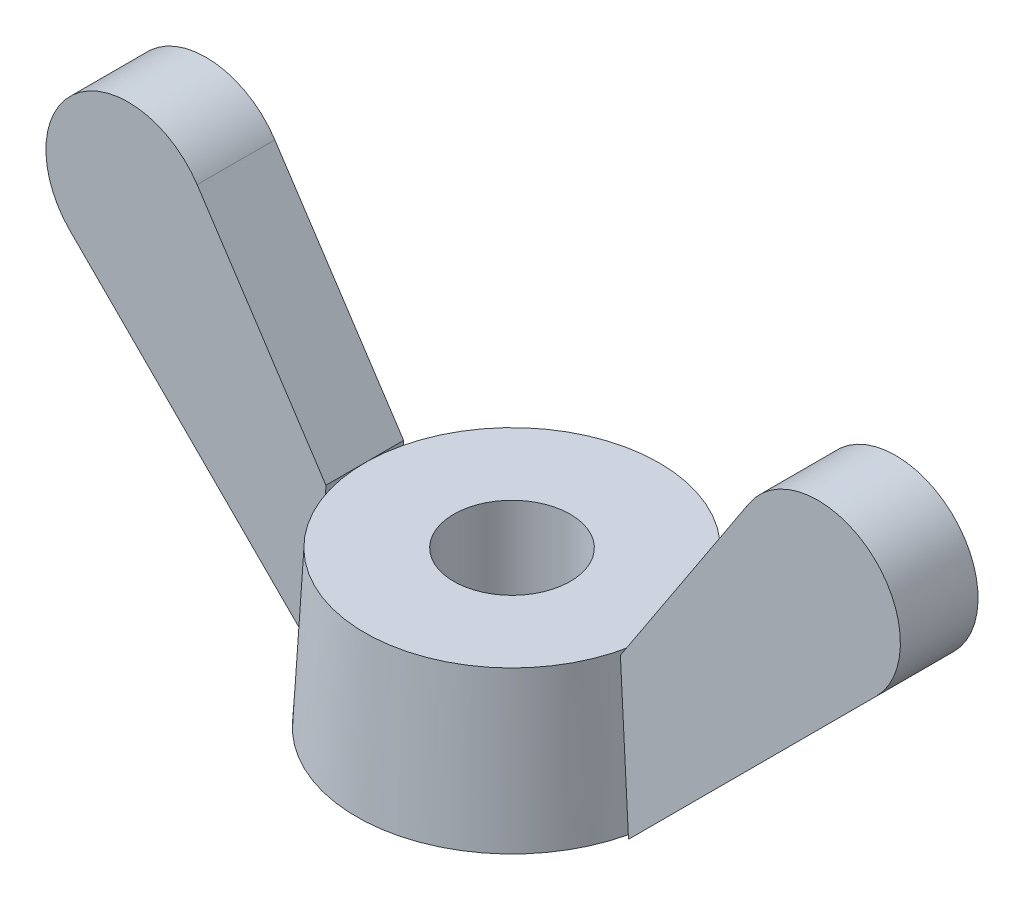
from build123d import *

# Parameters (mm, degrees)
BOSS_EXTRU_1_DEPTH   = 1
BOSS_EXTRU_1_2_DEPTH = 1


with BuildPart() as part:
    # Esquisse1 → R_volution1 (revolve)
    with BuildSketch(Plane.XY, mode=Mode.PRIVATE) as r_volution1_sk:
        Polygon((1.5, 0), (4, 0), (3.790368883, 4), (1.5, 4), align=None)
    revolve(r_volution1_sk.sketch.rotate(Axis((0, 0, 0), (0, 1, 0)), 90), axis=Axis((0, 0, 0), (0, 1, 0)))


with BuildPart() as body_2:
    # Esquisse2 → Boss.-Extru.1 (new, symmetric)
    with BuildSketch(Plane.XY):
        with BuildLine():
            Line((-10.378679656, 6.378679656), (-4, 0))
            Line((-4, 0), (-3.790368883, 4))
            Line((-3.790368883, 4), (-7.106058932, 9.043933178))
            ThreePointArc((-7.106058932, 9.043933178), (-10.218259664, 9.523527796), (-10.378679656, 6.378679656))
        make_face()
    extrude(amount=BOSS_EXTRU_1_DEPTH, both=True)


with BuildPart() as body_3:
    # Esquisse2 → Boss.-Extru.1 2 (new, symmetric)
    with BuildSketch(Plane.XY):
        with BuildLine():
            Line((10.378679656, 6.378679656), (4, 0))
            Line((4, 0), (3.790368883, 4))
            Line((3.790368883, 4), (7.106058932, 9.043933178))
            ThreePointArc((7.106058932, 9.043933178), (10.218259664, 9.523527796), (10.378679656, 6.378679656))
        make_face()
    extrude(amount=BOSS_EXTRU_1_2_DEPTH, both=True)


solid = Compound([part.part, body_2.part, body_3.part])
